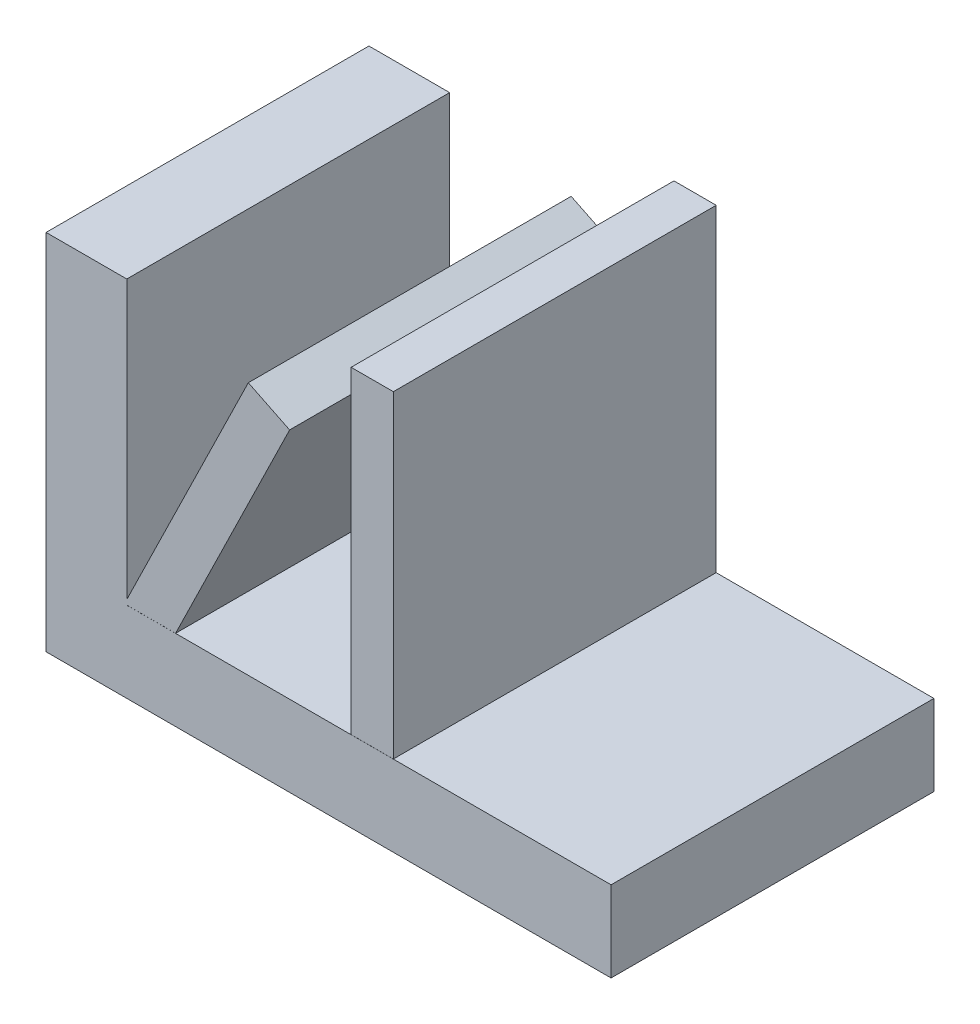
from build123d import *

# Parameters (mm, degrees)
EXTRUDE1_DEPTH = 20
SKETCH2_W      = 5.233644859
SKETCH2_H      = 39.414018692
EXTRUDE2_DEPTH = 20


with BuildPart() as part:
    # Sketch1 → Extrude1 (new, symmetric)
    with BuildSketch(Plane.XY):
        Polygon((0, 0), (70, 0), (70, 10), (10, 10), (10, 45), (0, 45), align=None)
    extrude(amount=EXTRUDE1_DEPTH, both=True)

    # Sketch2 → Extrude2 (add, symmetric)
    with BuildSketch(Plane.XY):
        with Locations((40.408099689, 29.716666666)):
            Rectangle(SKETCH2_W, SKETCH2_H)
        Polygon((9.704049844, 10.00965732), (25.056074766, 41.398753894), (30.174552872, 38.895368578), (16.046903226, 10.00965732), align=None)
    extrude(amount=EXTRUDE2_DEPTH, both=True)


with BuildPart() as extrude2_piece_1:
    # of the separate pieces the step leaves, piece 1, a body of its own (extrude2_pieces)
    add(part.part.solids().sort_by_distance((0, 0, -20))[0])


with BuildPart() as extrude2_piece_2:
    # of the separate pieces the step leaves, piece 2, a body of its own (extrude2_pieces)
    add(part.part.solids().sort_by_distance((43.024922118, 10.00965732, -20))[0])


solid = Compound([extrude2_piece_1.part, extrude2_piece_2.part])
